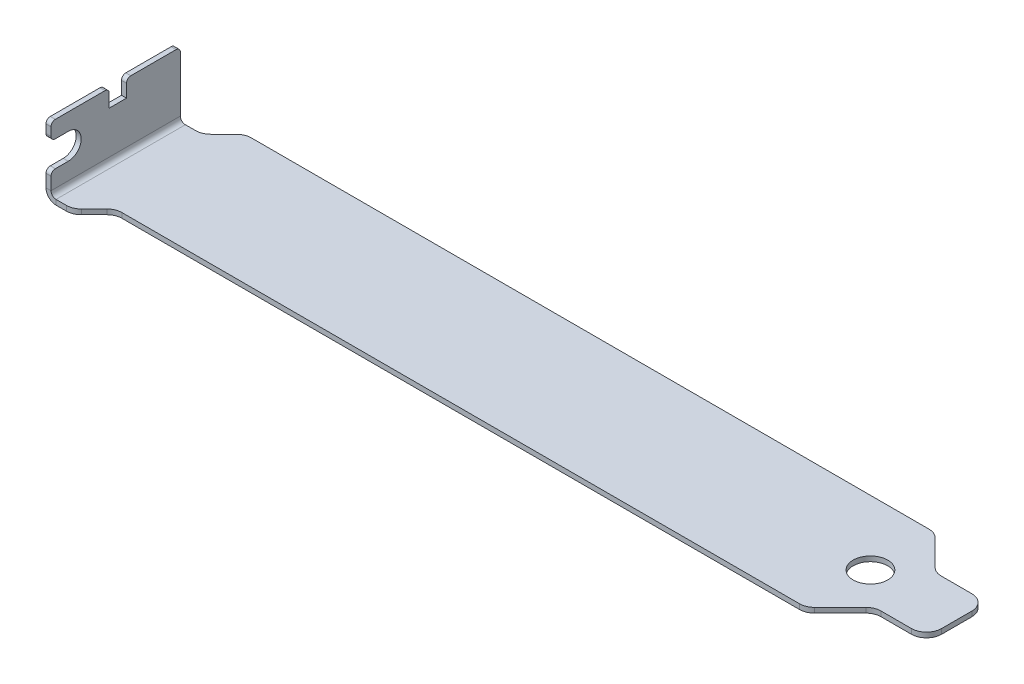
ISO-10303-21;
HEADER;
FILE_DESCRIPTION(('STEP AP214'),'2;1');
FILE_NAME('part.step','',(''),(''),'','','');
FILE_SCHEMA(('AUTOMOTIVE_DESIGN { 1 0 10303 214 1 1 1 1 }'));
ENDSEC;
DATA;
#1=APPLICATION_CONTEXT('core data for automotive mechanical design processes');
#2=APPLICATION_PROTOCOL_DEFINITION('international standard','automotive_design',2000,#1);
#3=PRODUCT_CONTEXT('',#1,'mechanical');
#4=PRODUCT('Part','Part','',(#3));
#5=PRODUCT_RELATED_PRODUCT_CATEGORY('part','',(#4));
#6=PRODUCT_DEFINITION_FORMATION('','',#4);
#7=PRODUCT_DEFINITION_CONTEXT('part definition',#1,'design');
#8=PRODUCT_DEFINITION('design','',#6,#7);
#9=PRODUCT_DEFINITION_SHAPE('','',#8);
#10=(LENGTH_UNIT() NAMED_UNIT(*) SI_UNIT(.MILLI.,.METRE.));
#11=(NAMED_UNIT(*) PLANE_ANGLE_UNIT() SI_UNIT($,.RADIAN.));
#12=(NAMED_UNIT(*) SI_UNIT($,.STERADIAN.) SOLID_ANGLE_UNIT());
#13=UNCERTAINTY_MEASURE_WITH_UNIT(LENGTH_MEASURE(1.E-05),#10,'distance_accuracy_value','');
#14=(GEOMETRIC_REPRESENTATION_CONTEXT(3) GLOBAL_UNCERTAINTY_ASSIGNED_CONTEXT((#13)) GLOBAL_UNIT_ASSIGNED_CONTEXT((#10,
#11,#12)) REPRESENTATION_CONTEXT('',''));
#15=CARTESIAN_POINT('',(0.,0.,0.));
#16=DIRECTION('',(0.,0.,1.));
#17=DIRECTION('',(1.,0.,0.));
#18=AXIS2_PLACEMENT_3D('',#15,#16,#17);
#19=CARTESIAN_POINT('',(-7.08660000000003,10.2616,-15.875));
#20=DIRECTION('',(0.,-1.,0.));
#21=DIRECTION('',(1.,0.,0.));
#22=AXIS2_PLACEMENT_3D('',#19,#20,#21);
#23=PLANE('',#22);
#24=DIRECTION('',(0.,0.,-1.));
#25=VECTOR('',#24,1.);
#26=CARTESIAN_POINT('',(-7.08660000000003,10.2616,-15.875));
#27=LINE('',#26,#25);
#28=CARTESIAN_POINT('',(-7.08660000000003,10.2616,2.53999999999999));
#29=VERTEX_POINT('',#28);
#30=CARTESIAN_POINT('',(-7.08660000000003,10.2616,-4.7625));
#31=VERTEX_POINT('',#30);
#32=EDGE_CURVE('E382',#29,#31,#27,.T.);
#33=ORIENTED_EDGE('',*,*,#32,.F.);
#34=DIRECTION('',(1.,0.,0.));
#35=VECTOR('',#34,1.);
#36=CARTESIAN_POINT('',(-7.08660000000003,10.2616,2.53999999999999));
#37=LINE('',#36,#35);
#38=CARTESIAN_POINT('',(-6.35000000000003,10.2616,2.53999999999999));
#39=VERTEX_POINT('',#38);
#40=EDGE_CURVE('E602',#29,#39,#37,.T.);
#41=ORIENTED_EDGE('',*,*,#40,.T.);
#42=DIRECTION('',(0.,0.,-1.));
#43=VECTOR('',#42,1.);
#44=CARTESIAN_POINT('',(-6.35000000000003,10.2616,-15.875));
#45=LINE('',#44,#43);
#46=CARTESIAN_POINT('',(-6.35000000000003,10.2616,-4.7625));
#47=VERTEX_POINT('',#46);
#48=EDGE_CURVE('E380',#39,#47,#45,.T.);
#49=ORIENTED_EDGE('',*,*,#48,.T.);
#50=DIRECTION('',(1.,0.,0.));
#51=VECTOR('',#50,1.);
#52=CARTESIAN_POINT('',(-7.08660000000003,10.2616,-4.7625));
#53=LINE('',#52,#51);
#54=EDGE_CURVE('E601',#47,#31,#53,.F.);
#55=ORIENTED_EDGE('',*,*,#54,.T.);
#56=EDGE_LOOP('',(#33,#41,#49,#55));
#57=FACE_BOUND('',#56,.T.);
#58=ADVANCED_FACE('F50',(#57),#23,.F.);
#59=CARTESIAN_POINT('',(-7.08660000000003,10.2616,3.17499999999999));
#60=DIRECTION('',(0.,0.,-1.));
#61=DIRECTION('',(0.,1.,0.));
#62=AXIS2_PLACEMENT_3D('',#59,#60,#61);
#63=PLANE('',#62);
#64=DIRECTION('',(0.,1.,0.));
#65=VECTOR('',#64,1.);
#66=CARTESIAN_POINT('',(-6.35000000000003,10.2616,3.17499999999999));
#67=LINE('',#66,#65);
#68=CARTESIAN_POINT('',(-6.35,1.4732,3.175));
#69=VERTEX_POINT('',#68);
#70=CARTESIAN_POINT('',(-6.35000000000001,3.3274,3.175));
#71=VERTEX_POINT('',#70);
#72=EDGE_CURVE('E387',#69,#71,#67,.T.);
#73=ORIENTED_EDGE('',*,*,#72,.T.);
#74=DIRECTION('',(1.,0.,0.));
#75=VECTOR('',#74,1.);
#76=CARTESIAN_POINT('',(-7.08660000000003,3.3274,3.175));
#77=LINE('',#76,#75);
#78=CARTESIAN_POINT('',(-7.08660000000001,3.3274,3.175));
#79=VERTEX_POINT('',#78);
#80=EDGE_CURVE('E581',#71,#79,#77,.F.);
#81=ORIENTED_EDGE('',*,*,#80,.T.);
#82=DIRECTION('',(0.,1.,0.));
#83=VECTOR('',#82,1.);
#84=CARTESIAN_POINT('',(-7.08660000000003,10.2616,3.17499999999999));
#85=LINE('',#84,#83);
#86=CARTESIAN_POINT('',(-7.0866,1.47319999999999,3.175));
#87=VERTEX_POINT('',#86);
#88=EDGE_CURVE('E378',#87,#79,#85,.T.);
#89=ORIENTED_EDGE('',*,*,#88,.F.);
#90=DIRECTION('',(-1.,0.,0.));
#91=VECTOR('',#90,1.);
#92=CARTESIAN_POINT('',(-6.35,1.4732,3.175));
#93=LINE('',#92,#91);
#94=EDGE_CURVE('E364',#69,#87,#93,.T.);
#95=ORIENTED_EDGE('',*,*,#94,.F.);
#96=EDGE_LOOP('',(#73,#81,#89,#95));
#97=FACE_BOUND('',#96,.T.);
#98=ADVANCED_FACE('F661',(#97),#63,.F.);
#99=CARTESIAN_POINT('',(-4.09558964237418,0.7366,-15.875));
#100=DIRECTION('',(0.,0.,1.));
#101=DIRECTION('',(1.,0.,0.));
#102=AXIS2_PLACEMENT_3D('',#99,#100,#101);
#103=PLANE('',#102);
#104=DIRECTION('',(0.,-1.,0.));
#105=VECTOR('',#104,1.);
#106=CARTESIAN_POINT('',(-5.6134,0.736599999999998,-15.875));
#107=LINE('',#106,#105);
#108=CARTESIAN_POINT('',(-5.6134,0.7366,-15.875));
#109=VERTEX_POINT('',#108);
#110=CARTESIAN_POINT('',(-5.6134,0.,-15.875));
#111=VERTEX_POINT('',#110);
#112=EDGE_CURVE('E406',#109,#111,#107,.T.);
#113=ORIENTED_EDGE('',*,*,#112,.F.);
#114=DIRECTION('',(-1.,0.,0.));
#115=VECTOR('',#114,1.);
#116=CARTESIAN_POINT('',(-4.09558964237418,0.7366,-15.875));
#117=LINE('',#116,#115);
#118=CARTESIAN_POINT('',(-4.09558964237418,0.7366,-15.875));
#119=VERTEX_POINT('',#118);
#120=EDGE_CURVE('E455',#119,#109,#117,.T.);
#121=ORIENTED_EDGE('',*,*,#120,.F.);
#122=DIRECTION('',(0.,-1.,0.));
#123=VECTOR('',#122,1.);
#124=CARTESIAN_POINT('',(-4.09558964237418,0.7366,-15.875));
#125=LINE('',#124,#123);
#126=CARTESIAN_POINT('',(-4.09558964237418,0.,-15.875));
#127=VERTEX_POINT('',#126);
#128=EDGE_CURVE('E525',#119,#127,#125,.T.);
#129=ORIENTED_EDGE('',*,*,#128,.T.);
#130=DIRECTION('',(-1.,0.,0.));
#131=VECTOR('',#130,1.);
#132=CARTESIAN_POINT('',(-4.09558964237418,0.,-15.875));
#133=LINE('',#132,#131);
#134=EDGE_CURVE('E500',#127,#111,#133,.T.);
#135=ORIENTED_EDGE('',*,*,#134,.T.);
#136=EDGE_LOOP('',(#113,#121,#129,#135));
#137=FACE_BOUND('',#136,.T.);
#138=ADVANCED_FACE('F648',(#137),#103,.F.);
#139=CARTESIAN_POINT('',(-6.35,0.7366,3.175));
#140=DIRECTION('',(0.,0.,-1.));
#141=DIRECTION('',(-1.,0.,0.));
#142=AXIS2_PLACEMENT_3D('',#139,#140,#141);
#143=PLANE('',#142);
#144=DIRECTION('',(0.,-1.,0.));
#145=VECTOR('',#144,1.);
#146=CARTESIAN_POINT('',(-5.6134,0.736599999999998,3.175));
#147=LINE('',#146,#145);
#148=CARTESIAN_POINT('',(-5.6134,0.7366,3.175));
#149=VERTEX_POINT('',#148);
#150=CARTESIAN_POINT('',(-5.6134,0.,3.175));
#151=VERTEX_POINT('',#150);
#152=EDGE_CURVE('E400',#149,#151,#147,.T.);
#153=ORIENTED_EDGE('',*,*,#152,.T.);
#154=DIRECTION('',(1.,0.,0.));
#155=VECTOR('',#154,1.);
#156=CARTESIAN_POINT('',(-6.35,0.,3.175));
#157=LINE('',#156,#155);
#158=CARTESIAN_POINT('',(-4.0955896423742,0.,3.175));
#159=VERTEX_POINT('',#158);
#160=EDGE_CURVE('E498',#151,#159,#157,.T.);
#161=ORIENTED_EDGE('',*,*,#160,.T.);
#162=DIRECTION('',(0.,-1.,0.));
#163=VECTOR('',#162,1.);
#164=CARTESIAN_POINT('',(-4.0955896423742,0.7366,3.175));
#165=LINE('',#164,#163);
#166=CARTESIAN_POINT('',(-4.0955896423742,0.7366,3.175));
#167=VERTEX_POINT('',#166);
#168=EDGE_CURVE('E516',#167,#159,#165,.T.);
#169=ORIENTED_EDGE('',*,*,#168,.F.);
#170=DIRECTION('',(1.,0.,0.));
#171=VECTOR('',#170,1.);
#172=CARTESIAN_POINT('',(-6.35,0.7366,3.175));
#173=LINE('',#172,#171);
#174=EDGE_CURVE('E457',#149,#167,#173,.T.);
#175=ORIENTED_EDGE('',*,*,#174,.F.);
#176=EDGE_LOOP('',(#153,#161,#169,#175));
#177=FACE_BOUND('',#176,.T.);
#178=ADVANCED_FACE('F872',(#177),#143,.F.);
#179=CARTESIAN_POINT('',(100.679410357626,0.7366,-2.2225));
#180=DIRECTION('',(0.,1.,0.));
#181=DIRECTION('',(0.,0.,1.));
#182=AXIS2_PLACEMENT_3D('',#179,#180,#181);
#183=PLANE('',#182);
#184=CARTESIAN_POINT('',(101.6,0.7366,-9.525));
#185=DIRECTION('',(0.,1.,0.));
#186=DIRECTION('',(0.,0.,1.));
#187=AXIS2_PLACEMENT_3D('',#184,#185,#186);
#188=CIRCLE('',#187,2.54);
#189=CARTESIAN_POINT('',(101.6,0.7366,-6.985));
#190=VERTEX_POINT('',#189);
#191=EDGE_CURVE('E415',#190,#190,#188,.T.);
#192=ORIENTED_EDGE('',*,*,#191,.F.);
#193=EDGE_LOOP('',(#192));
#194=FACE_BOUND('',#193,.T.);
#195=ORIENTED_EDGE('',*,*,#120,.T.);
#196=DIRECTION('',(0.,0.,1.));
#197=VECTOR('',#196,1.);
#198=CARTESIAN_POINT('',(-5.6134,0.736599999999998,3.175));
#199=LINE('',#198,#197);
#200=EDGE_CURVE('E404',#149,#109,#199,.F.);
#201=ORIENTED_EDGE('',*,*,#200,.F.);
#202=ORIENTED_EDGE('',*,*,#174,.T.);
#203=CARTESIAN_POINT('',(-4.0955896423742,0.7366,0.952500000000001));
#204=DIRECTION('',(0.,1.,0.));
#205=DIRECTION('',(0.,0.,1.));
#206=AXIS2_PLACEMENT_3D('',#203,#204,#205);
#207=CIRCLE('',#206,2.2225);
#208=CARTESIAN_POINT('',(-2.52404482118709,0.7366,2.52404482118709));
#209=VERTEX_POINT('',#208);
#210=EDGE_CURVE('E456',#167,#209,#207,.T.);
#211=ORIENTED_EDGE('',*,*,#210,.T.);
#212=DIRECTION('',(0.707106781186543,0.,-0.707106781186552));
#213=VECTOR('',#212,1.);
#214=CARTESIAN_POINT('',(-2.52404482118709,0.7366,2.52404482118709));
#215=LINE('',#214,#213);
#216=CARTESIAN_POINT('',(-0.650955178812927,0.7366,0.650955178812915));
#217=VERTEX_POINT('',#216);
#218=EDGE_CURVE('E458',#209,#217,#215,.T.);
#219=ORIENTED_EDGE('',*,*,#218,.T.);
#220=CARTESIAN_POINT('',(0.920589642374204,0.7366,2.2225));
#221=DIRECTION('',(0.,-1.,0.));
#222=DIRECTION('',(0.,0.,1.));
#223=AXIS2_PLACEMENT_3D('',#220,#221,#222);
#224=CIRCLE('',#223,2.22250000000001);
#225=CARTESIAN_POINT('',(0.920589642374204,0.7366,0.));
#226=VERTEX_POINT('',#225);
#227=EDGE_CURVE('E464',#217,#226,#224,.T.);
#228=ORIENTED_EDGE('',*,*,#227,.T.);
#229=DIRECTION('',(1.,0.,0.));
#230=VECTOR('',#229,1.);
#231=CARTESIAN_POINT('',(0.920589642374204,0.7366,0.));
#232=LINE('',#231,#230);
#233=CARTESIAN_POINT('',(100.679410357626,0.7366,0.));
#234=VERTEX_POINT('',#233);
#235=EDGE_CURVE('E465',#226,#234,#232,.T.);
#236=ORIENTED_EDGE('',*,*,#235,.T.);
#237=CARTESIAN_POINT('',(100.679410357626,0.7366,-2.2225));
#238=DIRECTION('',(0.,1.,0.));
#239=DIRECTION('',(0.,0.,1.));
#240=AXIS2_PLACEMENT_3D('',#237,#238,#239);
#241=CIRCLE('',#240,2.2225);
#242=CARTESIAN_POINT('',(102.250955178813,0.7366,-0.650955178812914));
#243=VERTEX_POINT('',#242);
#244=EDGE_CURVE('E423',#234,#243,#241,.T.);
#245=ORIENTED_EDGE('',*,*,#244,.T.);
#246=DIRECTION('',(0.70710678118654,0.,-0.707106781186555));
#247=VECTOR('',#246,1.);
#248=CARTESIAN_POINT('',(102.250955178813,0.7366,-0.650955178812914));
#249=LINE('',#248,#247);
#250=CARTESIAN_POINT('',(106.029044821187,0.7366,-4.42904482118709));
#251=VERTEX_POINT('',#250);
#252=EDGE_CURVE('E424',#243,#251,#249,.T.);
#253=ORIENTED_EDGE('',*,*,#252,.T.);
#254=CARTESIAN_POINT('',(107.600589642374,0.7366,-2.8575));
#255=DIRECTION('',(0.,-1.,0.));
#256=DIRECTION('',(0.,0.,-1.));
#257=AXIS2_PLACEMENT_3D('',#254,#255,#256);
#258=CIRCLE('',#257,2.2225);
#259=CARTESIAN_POINT('',(107.600589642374,0.7366,-5.08));
#260=VERTEX_POINT('',#259);
#261=EDGE_CURVE('E430',#251,#260,#258,.T.);
#262=ORIENTED_EDGE('',*,*,#261,.T.);
#263=DIRECTION('',(1.,0.,0.));
#264=VECTOR('',#263,1.);
#265=CARTESIAN_POINT('',(107.600589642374,0.7366,-5.08));
#266=LINE('',#265,#264);
#267=CARTESIAN_POINT('',(112.0775,0.7366,-5.08));
#268=VERTEX_POINT('',#267);
#269=EDGE_CURVE('E427',#260,#268,#266,.T.);
#270=ORIENTED_EDGE('',*,*,#269,.T.);
#271=CARTESIAN_POINT('',(112.0775,0.7366,-7.3025));
#272=DIRECTION('',(0.,1.,0.));
#273=DIRECTION('',(0.,0.,1.));
#274=AXIS2_PLACEMENT_3D('',#271,#272,#273);
#275=CIRCLE('',#274,2.2225);
#276=CARTESIAN_POINT('',(114.3,0.7366,-7.3025));
#277=VERTEX_POINT('',#276);
#278=EDGE_CURVE('E431',#268,#277,#275,.T.);
#279=ORIENTED_EDGE('',*,*,#278,.T.);
#280=DIRECTION('',(0.,0.,-1.));
#281=VECTOR('',#280,1.);
#282=CARTESIAN_POINT('',(114.3,0.7366,-11.7475));
#283=LINE('',#282,#281);
#284=CARTESIAN_POINT('',(114.3,0.7366,-11.7475));
#285=VERTEX_POINT('',#284);
#286=EDGE_CURVE('E433',#277,#285,#283,.T.);
#287=ORIENTED_EDGE('',*,*,#286,.T.);
#288=CARTESIAN_POINT('',(112.0775,0.7366,-11.7475));
#289=DIRECTION('',(0.,1.,0.));
#290=DIRECTION('',(0.,0.,-1.));
#291=AXIS2_PLACEMENT_3D('',#288,#289,#290);
#292=CIRCLE('',#291,2.2225);
#293=CARTESIAN_POINT('',(112.0775,0.7366,-13.97));
#294=VERTEX_POINT('',#293);
#295=EDGE_CURVE('E434',#285,#294,#292,.T.);
#296=ORIENTED_EDGE('',*,*,#295,.T.);
#297=DIRECTION('',(-1.,0.,0.));
#298=VECTOR('',#297,1.);
#299=CARTESIAN_POINT('',(107.600589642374,0.7366,-13.97));
#300=LINE('',#299,#298);
#301=CARTESIAN_POINT('',(107.600589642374,0.7366,-13.97));
#302=VERTEX_POINT('',#301);
#303=EDGE_CURVE('E440',#294,#302,#300,.T.);
#304=ORIENTED_EDGE('',*,*,#303,.T.);
#305=CARTESIAN_POINT('',(107.600589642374,0.7366,-16.1925));
#306=DIRECTION('',(0.,-1.,0.));
#307=DIRECTION('',(0.,0.,1.));
#308=AXIS2_PLACEMENT_3D('',#305,#306,#307);
#309=CIRCLE('',#308,2.2225);
#310=CARTESIAN_POINT('',(106.029044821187,0.7366,-14.6209551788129));
#311=VERTEX_POINT('',#310);
#312=EDGE_CURVE('E438',#302,#311,#309,.T.);
#313=ORIENTED_EDGE('',*,*,#312,.T.);
#314=DIRECTION('',(-0.707106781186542,0.,-0.707106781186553));
#315=VECTOR('',#314,1.);
#316=CARTESIAN_POINT('',(102.250955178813,0.7366,-18.3990448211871));
#317=LINE('',#316,#315);
#318=CARTESIAN_POINT('',(102.250955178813,0.7366,-18.3990448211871));
#319=VERTEX_POINT('',#318);
#320=EDGE_CURVE('E442',#311,#319,#317,.T.);
#321=ORIENTED_EDGE('',*,*,#320,.T.);
#322=CARTESIAN_POINT('',(100.679410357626,0.7366,-16.8275));
#323=DIRECTION('',(0.,1.,0.));
#324=DIRECTION('',(0.,0.,-1.));
#325=AXIS2_PLACEMENT_3D('',#322,#323,#324);
#326=CIRCLE('',#325,2.2225);
#327=CARTESIAN_POINT('',(100.679410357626,0.7366,-19.05));
#328=VERTEX_POINT('',#327);
#329=EDGE_CURVE('E444',#319,#328,#326,.T.);
#330=ORIENTED_EDGE('',*,*,#329,.T.);
#331=DIRECTION('',(-1.,0.,0.));
#332=VECTOR('',#331,1.);
#333=CARTESIAN_POINT('',(0.920589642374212,0.7366,-19.05));
#334=LINE('',#333,#332);
#335=CARTESIAN_POINT('',(0.920589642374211,0.7366,-19.05));
#336=VERTEX_POINT('',#335);
#337=EDGE_CURVE('E443',#328,#336,#334,.T.);
#338=ORIENTED_EDGE('',*,*,#337,.T.);
#339=CARTESIAN_POINT('',(0.920589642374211,0.7366,-16.8275));
#340=DIRECTION('',(0.,1.,0.));
#341=DIRECTION('',(0.,0.,-1.));
#342=AXIS2_PLACEMENT_3D('',#339,#340,#341);
#343=CIRCLE('',#342,2.2225);
#344=CARTESIAN_POINT('',(-0.650955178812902,0.7366,-18.3990448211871));
#345=VERTEX_POINT('',#344);
#346=EDGE_CURVE('E447',#336,#345,#343,.T.);
#347=ORIENTED_EDGE('',*,*,#346,.T.);
#348=DIRECTION('',(-0.707106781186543,0.,0.707106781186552));
#349=VECTOR('',#348,1.);
#350=CARTESIAN_POINT('',(-0.650955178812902,0.7366,-18.3990448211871));
#351=LINE('',#350,#349);
#352=CARTESIAN_POINT('',(-2.52404482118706,0.7366,-16.5259551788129));
#353=VERTEX_POINT('',#352);
#354=EDGE_CURVE('E448',#345,#353,#351,.T.);
#355=ORIENTED_EDGE('',*,*,#354,.T.);
#356=CARTESIAN_POINT('',(-4.09558964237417,0.7366,-18.0975));
#357=DIRECTION('',(0.,-1.,0.));
#358=DIRECTION('',(0.,0.,-1.));
#359=AXIS2_PLACEMENT_3D('',#356,#357,#358);
#360=CIRCLE('',#359,2.2225);
#361=EDGE_CURVE('E452',#353,#119,#360,.T.);
#362=ORIENTED_EDGE('',*,*,#361,.T.);
#363=EDGE_LOOP('',(#195,#201,#202,#211,#219,#228,#236,#245,#253,#262,#270,#279,#287,#296,#304,
#313,#321,#330,#338,#347,#355,#362));
#364=FACE_BOUND('',#363,.T.);
#365=ADVANCED_FACE('F651',(#194,#364),#183,.T.);
#366=CARTESIAN_POINT('',(100.679410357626,0.,-2.2225));
#367=DIRECTION('',(0.,1.,0.));
#368=DIRECTION('',(0.,0.,1.));
#369=AXIS2_PLACEMENT_3D('',#366,#367,#368);
#370=PLANE('',#369);
#371=CARTESIAN_POINT('',(101.6,0.,-9.525));
#372=DIRECTION('',(0.,1.,0.));
#373=DIRECTION('',(0.,0.,1.));
#374=AXIS2_PLACEMENT_3D('',#371,#372,#373);
#375=CIRCLE('',#374,2.54);
#376=CARTESIAN_POINT('',(101.6,0.,-6.985));
#377=VERTEX_POINT('',#376);
#378=EDGE_CURVE('E413',#377,#377,#375,.T.);
#379=ORIENTED_EDGE('',*,*,#378,.T.);
#380=EDGE_LOOP('',(#379));
#381=FACE_BOUND('',#380,.T.);
#382=DIRECTION('',(0.,0.,1.));
#383=VECTOR('',#382,1.);
#384=CARTESIAN_POINT('',(-5.6134,0.,3.175));
#385=LINE('',#384,#383);
#386=EDGE_CURVE('E392',#151,#111,#385,.F.);
#387=ORIENTED_EDGE('',*,*,#386,.T.);
#388=ORIENTED_EDGE('',*,*,#134,.F.);
#389=CARTESIAN_POINT('',(-4.09558964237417,0.,-18.0975));
#390=DIRECTION('',(0.,-1.,0.));
#391=DIRECTION('',(0.,0.,-1.));
#392=AXIS2_PLACEMENT_3D('',#389,#390,#391);
#393=CIRCLE('',#392,2.2225);
#394=CARTESIAN_POINT('',(-2.52404482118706,0.,-16.5259551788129));
#395=VERTEX_POINT('',#394);
#396=EDGE_CURVE('E494',#395,#127,#393,.T.);
#397=ORIENTED_EDGE('',*,*,#396,.F.);
#398=DIRECTION('',(-0.707106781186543,0.,0.707106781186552));
#399=VECTOR('',#398,1.);
#400=CARTESIAN_POINT('',(-0.650955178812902,0.,-18.3990448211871));
#401=LINE('',#400,#399);
#402=CARTESIAN_POINT('',(-0.650955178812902,0.,-18.3990448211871));
#403=VERTEX_POINT('',#402);
#404=EDGE_CURVE('E492',#403,#395,#401,.T.);
#405=ORIENTED_EDGE('',*,*,#404,.F.);
#406=CARTESIAN_POINT('',(0.920589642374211,0.,-16.8275));
#407=DIRECTION('',(0.,1.,0.));
#408=DIRECTION('',(0.,0.,-1.));
#409=AXIS2_PLACEMENT_3D('',#406,#407,#408);
#410=CIRCLE('',#409,2.2225);
#411=CARTESIAN_POINT('',(0.920589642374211,0.,-19.05));
#412=VERTEX_POINT('',#411);
#413=EDGE_CURVE('E491',#412,#403,#410,.T.);
#414=ORIENTED_EDGE('',*,*,#413,.F.);
#415=DIRECTION('',(-1.,0.,0.));
#416=VECTOR('',#415,1.);
#417=CARTESIAN_POINT('',(0.920589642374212,0.,-19.05));
#418=LINE('',#417,#416);
#419=CARTESIAN_POINT('',(100.679410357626,0.,-19.05));
#420=VERTEX_POINT('',#419);
#421=EDGE_CURVE('E487',#420,#412,#418,.T.);
#422=ORIENTED_EDGE('',*,*,#421,.F.);
#423=CARTESIAN_POINT('',(100.679410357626,0.,-16.8275));
#424=DIRECTION('',(0.,1.,0.));
#425=DIRECTION('',(0.,0.,-1.));
#426=AXIS2_PLACEMENT_3D('',#423,#424,#425);
#427=CIRCLE('',#426,2.2225);
#428=CARTESIAN_POINT('',(102.250955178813,0.,-18.3990448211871));
#429=VERTEX_POINT('',#428);
#430=EDGE_CURVE('E490',#429,#420,#427,.T.);
#431=ORIENTED_EDGE('',*,*,#430,.F.);
#432=DIRECTION('',(-0.707106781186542,0.,-0.707106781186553));
#433=VECTOR('',#432,1.);
#434=CARTESIAN_POINT('',(102.250955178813,0.,-18.3990448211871));
#435=LINE('',#434,#433);
#436=CARTESIAN_POINT('',(106.029044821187,0.,-14.6209551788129));
#437=VERTEX_POINT('',#436);
#438=EDGE_CURVE('E484',#437,#429,#435,.T.);
#439=ORIENTED_EDGE('',*,*,#438,.F.);
#440=CARTESIAN_POINT('',(107.600589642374,0.,-16.1925));
#441=DIRECTION('',(0.,-1.,0.));
#442=DIRECTION('',(0.,0.,1.));
#443=AXIS2_PLACEMENT_3D('',#440,#441,#442);
#444=CIRCLE('',#443,2.2225);
#445=CARTESIAN_POINT('',(107.600589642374,0.,-13.97));
#446=VERTEX_POINT('',#445);
#447=EDGE_CURVE('E483',#446,#437,#444,.T.);
#448=ORIENTED_EDGE('',*,*,#447,.F.);
#449=DIRECTION('',(-1.,0.,0.));
#450=VECTOR('',#449,1.);
#451=CARTESIAN_POINT('',(107.600589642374,0.,-13.97));
#452=LINE('',#451,#450);
#453=CARTESIAN_POINT('',(112.0775,0.,-13.97));
#454=VERTEX_POINT('',#453);
#455=EDGE_CURVE('E481',#454,#446,#452,.T.);
#456=ORIENTED_EDGE('',*,*,#455,.F.);
#457=CARTESIAN_POINT('',(112.0775,0.,-11.7475));
#458=DIRECTION('',(0.,1.,0.));
#459=DIRECTION('',(0.,0.,-1.));
#460=AXIS2_PLACEMENT_3D('',#457,#458,#459);
#461=CIRCLE('',#460,2.2225);
#462=CARTESIAN_POINT('',(114.3,0.,-11.7475));
#463=VERTEX_POINT('',#462);
#464=EDGE_CURVE('E479',#463,#454,#461,.T.);
#465=ORIENTED_EDGE('',*,*,#464,.F.);
#466=DIRECTION('',(0.,0.,-1.));
#467=VECTOR('',#466,1.);
#468=CARTESIAN_POINT('',(114.3,0.,-11.7475));
#469=LINE('',#468,#467);
#470=CARTESIAN_POINT('',(114.3,0.,-7.3025));
#471=VERTEX_POINT('',#470);
#472=EDGE_CURVE('E480',#471,#463,#469,.T.);
#473=ORIENTED_EDGE('',*,*,#472,.F.);
#474=CARTESIAN_POINT('',(112.0775,0.,-7.3025));
#475=DIRECTION('',(0.,1.,0.));
#476=DIRECTION('',(0.,0.,1.));
#477=AXIS2_PLACEMENT_3D('',#474,#475,#476);
#478=CIRCLE('',#477,2.2225);
#479=CARTESIAN_POINT('',(112.0775,0.,-5.08));
#480=VERTEX_POINT('',#479);
#481=EDGE_CURVE('E474',#480,#471,#478,.T.);
#482=ORIENTED_EDGE('',*,*,#481,.F.);
#483=DIRECTION('',(1.,0.,0.));
#484=VECTOR('',#483,1.);
#485=CARTESIAN_POINT('',(107.600589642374,0.,-5.08));
#486=LINE('',#485,#484);
#487=CARTESIAN_POINT('',(107.600589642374,0.,-5.08));
#488=VERTEX_POINT('',#487);
#489=EDGE_CURVE('E471',#488,#480,#486,.T.);
#490=ORIENTED_EDGE('',*,*,#489,.F.);
#491=CARTESIAN_POINT('',(107.600589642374,0.,-2.8575));
#492=DIRECTION('',(0.,-1.,0.));
#493=DIRECTION('',(0.,0.,-1.));
#494=AXIS2_PLACEMENT_3D('',#491,#492,#493);
#495=CIRCLE('',#494,2.2225);
#496=CARTESIAN_POINT('',(106.029044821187,0.,-4.42904482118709));
#497=VERTEX_POINT('',#496);
#498=EDGE_CURVE('E473',#497,#488,#495,.T.);
#499=ORIENTED_EDGE('',*,*,#498,.F.);
#500=DIRECTION('',(0.70710678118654,0.,-0.707106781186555));
#501=VECTOR('',#500,1.);
#502=CARTESIAN_POINT('',(102.250955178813,0.,-0.650955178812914));
#503=LINE('',#502,#501);
#504=CARTESIAN_POINT('',(102.250955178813,0.,-0.650955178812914));
#505=VERTEX_POINT('',#504);
#506=EDGE_CURVE('E466',#505,#497,#503,.T.);
#507=ORIENTED_EDGE('',*,*,#506,.F.);
#508=CARTESIAN_POINT('',(100.679410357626,0.,-2.2225));
#509=DIRECTION('',(0.,1.,0.));
#510=DIRECTION('',(0.,0.,1.));
#511=AXIS2_PLACEMENT_3D('',#508,#509,#510);
#512=CIRCLE('',#511,2.2225);
#513=CARTESIAN_POINT('',(100.679410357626,0.,0.));
#514=VERTEX_POINT('',#513);
#515=EDGE_CURVE('E416',#514,#505,#512,.T.);
#516=ORIENTED_EDGE('',*,*,#515,.F.);
#517=DIRECTION('',(1.,0.,0.));
#518=VECTOR('',#517,1.);
#519=CARTESIAN_POINT('',(0.920589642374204,0.,0.));
#520=LINE('',#519,#518);
#521=CARTESIAN_POINT('',(0.920589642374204,0.,0.));
#522=VERTEX_POINT('',#521);
#523=EDGE_CURVE('E422',#522,#514,#520,.T.);
#524=ORIENTED_EDGE('',*,*,#523,.F.);
#525=CARTESIAN_POINT('',(0.920589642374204,0.,2.2225));
#526=DIRECTION('',(0.,-1.,0.));
#527=DIRECTION('',(0.,0.,1.));
#528=AXIS2_PLACEMENT_3D('',#525,#526,#527);
#529=CIRCLE('',#528,2.22250000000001);
#530=CARTESIAN_POINT('',(-0.650955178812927,0.,0.650955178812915));
#531=VERTEX_POINT('',#530);
#532=EDGE_CURVE('E507',#531,#522,#529,.T.);
#533=ORIENTED_EDGE('',*,*,#532,.F.);
#534=DIRECTION('',(0.707106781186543,0.,-0.707106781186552));
#535=VECTOR('',#534,1.);
#536=CARTESIAN_POINT('',(-2.52404482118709,0.,2.52404482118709));
#537=LINE('',#536,#535);
#538=CARTESIAN_POINT('',(-2.52404482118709,0.,2.52404482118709));
#539=VERTEX_POINT('',#538);
#540=EDGE_CURVE('E503',#539,#531,#537,.T.);
#541=ORIENTED_EDGE('',*,*,#540,.F.);
#542=CARTESIAN_POINT('',(-4.0955896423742,0.,0.952500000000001));
#543=DIRECTION('',(0.,1.,0.));
#544=DIRECTION('',(0.,0.,1.));
#545=AXIS2_PLACEMENT_3D('',#542,#543,#544);
#546=CIRCLE('',#545,2.2225);
#547=EDGE_CURVE('E502',#159,#539,#546,.T.);
#548=ORIENTED_EDGE('',*,*,#547,.F.);
#549=ORIENTED_EDGE('',*,*,#160,.F.);
#550=EDGE_LOOP('',(#387,#388,#397,#405,#414,#422,#431,#439,#448,#456,#465,#473,#482,#490,#499,
#507,#516,#524,#533,#541,#548,#549));
#551=FACE_BOUND('',#550,.T.);
#552=ADVANCED_FACE('F895',(#381,#551),#370,.F.);
#553=CARTESIAN_POINT('',(100.679410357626,0.7366,-2.2225));
#554=DIRECTION('',(0.,-1.,0.));
#555=DIRECTION('',(0.,0.,-1.));
#556=AXIS2_PLACEMENT_3D('',#553,#554,#555);
#557=CYLINDRICAL_SURFACE('',#556,2.2225);
#558=ORIENTED_EDGE('',*,*,#515,.T.);
#559=DIRECTION('',(0.,-1.,0.));
#560=VECTOR('',#559,1.);
#561=CARTESIAN_POINT('',(102.250955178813,0.7366,-0.650955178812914));
#562=LINE('',#561,#560);
#563=EDGE_CURVE('E563',#243,#505,#562,.T.);
#564=ORIENTED_EDGE('',*,*,#563,.F.);
#565=ORIENTED_EDGE('',*,*,#244,.F.);
#566=DIRECTION('',(0.,-1.,0.));
#567=VECTOR('',#566,1.);
#568=CARTESIAN_POINT('',(100.679410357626,0.7366,0.));
#569=LINE('',#568,#567);
#570=EDGE_CURVE('E467',#234,#514,#569,.T.);
#571=ORIENTED_EDGE('',*,*,#570,.T.);
#572=EDGE_LOOP('',(#558,#564,#565,#571));
#573=FACE_BOUND('',#572,.T.);
#574=ADVANCED_FACE('F902',(#573),#557,.T.);
#575=CARTESIAN_POINT('',(102.250955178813,0.7366,-0.650955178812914));
#576=DIRECTION('',(-0.707106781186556,0.,-0.70710678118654));
#577=DIRECTION('',(-0.70710678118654,0.,0.707106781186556));
#578=AXIS2_PLACEMENT_3D('',#575,#576,#577);
#579=PLANE('',#578);
#580=ORIENTED_EDGE('',*,*,#506,.T.);
#581=DIRECTION('',(0.,-1.,0.));
#582=VECTOR('',#581,1.);
#583=CARTESIAN_POINT('',(106.029044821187,0.7366,-4.42904482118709));
#584=LINE('',#583,#582);
#585=EDGE_CURVE('E564',#251,#497,#584,.T.);
#586=ORIENTED_EDGE('',*,*,#585,.F.);
#587=ORIENTED_EDGE('',*,*,#252,.F.);
#588=ORIENTED_EDGE('',*,*,#563,.T.);
#589=EDGE_LOOP('',(#580,#586,#587,#588));
#590=FACE_BOUND('',#589,.T.);
#591=ADVANCED_FACE('F1063',(#590),#579,.F.);
#592=CARTESIAN_POINT('',(107.600589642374,0.7366,-2.8575));
#593=DIRECTION('',(0.,-1.,0.));
#594=DIRECTION('',(0.,0.,-1.));
#595=AXIS2_PLACEMENT_3D('',#592,#593,#594);
#596=CYLINDRICAL_SURFACE('',#595,2.2225);
#597=ORIENTED_EDGE('',*,*,#498,.T.);
#598=DIRECTION('',(0.,-1.,0.));
#599=VECTOR('',#598,1.);
#600=CARTESIAN_POINT('',(107.600589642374,0.7366,-5.08));
#601=LINE('',#600,#599);
#602=EDGE_CURVE('E558',#260,#488,#601,.T.);
#603=ORIENTED_EDGE('',*,*,#602,.F.);
#604=ORIENTED_EDGE('',*,*,#261,.F.);
#605=ORIENTED_EDGE('',*,*,#585,.T.);
#606=EDGE_LOOP('',(#597,#603,#604,#605));
#607=FACE_BOUND('',#606,.T.);
#608=ADVANCED_FACE('F1057',(#607),#596,.F.);
#609=CARTESIAN_POINT('',(107.600589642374,0.7366,-5.08));
#610=DIRECTION('',(0.,0.,-1.));
#611=DIRECTION('',(-1.,0.,0.));
#612=AXIS2_PLACEMENT_3D('',#609,#610,#611);
#613=PLANE('',#612);
#614=ORIENTED_EDGE('',*,*,#489,.T.);
#615=DIRECTION('',(0.,-1.,0.));
#616=VECTOR('',#615,1.);
#617=CARTESIAN_POINT('',(112.0775,0.7366,-5.08));
#618=LINE('',#617,#616);
#619=EDGE_CURVE('E556',#268,#480,#618,.T.);
#620=ORIENTED_EDGE('',*,*,#619,.F.);
#621=ORIENTED_EDGE('',*,*,#269,.F.);
#622=ORIENTED_EDGE('',*,*,#602,.T.);
#623=EDGE_LOOP('',(#614,#620,#621,#622));
#624=FACE_BOUND('',#623,.T.);
#625=ADVANCED_FACE('F1050',(#624),#613,.F.);
#626=CARTESIAN_POINT('',(112.0775,0.7366,-7.3025));
#627=DIRECTION('',(0.,-1.,0.));
#628=DIRECTION('',(0.,0.,-1.));
#629=AXIS2_PLACEMENT_3D('',#626,#627,#628);
#630=CYLINDRICAL_SURFACE('',#629,2.2225);
#631=ORIENTED_EDGE('',*,*,#481,.T.);
#632=DIRECTION('',(0.,-1.,0.));
#633=VECTOR('',#632,1.);
#634=CARTESIAN_POINT('',(114.3,0.7366,-7.3025));
#635=LINE('',#634,#633);
#636=EDGE_CURVE('E554',#277,#471,#635,.T.);
#637=ORIENTED_EDGE('',*,*,#636,.F.);
#638=ORIENTED_EDGE('',*,*,#278,.F.);
#639=ORIENTED_EDGE('',*,*,#619,.T.);
#640=EDGE_LOOP('',(#631,#637,#638,#639));
#641=FACE_BOUND('',#640,.T.);
#642=ADVANCED_FACE('F1038',(#641),#630,.T.);
#643=CARTESIAN_POINT('',(114.3,0.7366,-11.7475));
#644=DIRECTION('',(-1.,0.,0.));
#645=DIRECTION('',(0.,0.,1.));
#646=AXIS2_PLACEMENT_3D('',#643,#644,#645);
#647=PLANE('',#646);
#648=ORIENTED_EDGE('',*,*,#472,.T.);
#649=DIRECTION('',(0.,-1.,0.));
#650=VECTOR('',#649,1.);
#651=CARTESIAN_POINT('',(114.3,0.7366,-11.7475));
#652=LINE('',#651,#650);
#653=EDGE_CURVE('E549',#285,#463,#652,.T.);
#654=ORIENTED_EDGE('',*,*,#653,.F.);
#655=ORIENTED_EDGE('',*,*,#286,.F.);
#656=ORIENTED_EDGE('',*,*,#636,.T.);
#657=EDGE_LOOP('',(#648,#654,#655,#656));
#658=FACE_BOUND('',#657,.T.);
#659=ADVANCED_FACE('F1029',(#658),#647,.F.);
#660=CARTESIAN_POINT('',(112.0775,0.7366,-11.7475));
#661=DIRECTION('',(0.,-1.,0.));
#662=DIRECTION('',(0.,0.,-1.));
#663=AXIS2_PLACEMENT_3D('',#660,#661,#662);
#664=CYLINDRICAL_SURFACE('',#663,2.2225);
#665=ORIENTED_EDGE('',*,*,#464,.T.);
#666=DIRECTION('',(0.,-1.,0.));
#667=VECTOR('',#666,1.);
#668=CARTESIAN_POINT('',(112.0775,0.7366,-13.97));
#669=LINE('',#668,#667);
#670=EDGE_CURVE('E550',#294,#454,#669,.T.);
#671=ORIENTED_EDGE('',*,*,#670,.F.);
#672=ORIENTED_EDGE('',*,*,#295,.F.);
#673=ORIENTED_EDGE('',*,*,#653,.T.);
#674=EDGE_LOOP('',(#665,#671,#672,#673));
#675=FACE_BOUND('',#674,.T.);
#676=ADVANCED_FACE('F1018',(#675),#664,.T.);
#677=CARTESIAN_POINT('',(107.600589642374,0.7366,-13.97));
#678=DIRECTION('',(0.,0.,1.));
#679=DIRECTION('',(1.,0.,0.));
#680=AXIS2_PLACEMENT_3D('',#677,#678,#679);
#681=PLANE('',#680);
#682=ORIENTED_EDGE('',*,*,#455,.T.);
#683=DIRECTION('',(0.,-1.,0.));
#684=VECTOR('',#683,1.);
#685=CARTESIAN_POINT('',(107.600589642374,0.7366,-13.97));
#686=LINE('',#685,#684);
#687=EDGE_CURVE('E542',#302,#446,#686,.T.);
#688=ORIENTED_EDGE('',*,*,#687,.F.);
#689=ORIENTED_EDGE('',*,*,#303,.F.);
#690=ORIENTED_EDGE('',*,*,#670,.T.);
#691=EDGE_LOOP('',(#682,#688,#689,#690));
#692=FACE_BOUND('',#691,.T.);
#693=ADVANCED_FACE('F1013',(#692),#681,.F.);
#694=CARTESIAN_POINT('',(107.600589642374,0.7366,-16.1925));
#695=DIRECTION('',(0.,-1.,0.));
#696=DIRECTION('',(0.,0.,-1.));
#697=AXIS2_PLACEMENT_3D('',#694,#695,#696);
#698=CYLINDRICAL_SURFACE('',#697,2.2225);
#699=ORIENTED_EDGE('',*,*,#447,.T.);
#700=DIRECTION('',(0.,-1.,0.));
#701=VECTOR('',#700,1.);
#702=CARTESIAN_POINT('',(106.029044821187,0.7366,-14.6209551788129));
#703=LINE('',#702,#701);
#704=EDGE_CURVE('E541',#311,#437,#703,.T.);
#705=ORIENTED_EDGE('',*,*,#704,.F.);
#706=ORIENTED_EDGE('',*,*,#312,.F.);
#707=ORIENTED_EDGE('',*,*,#687,.T.);
#708=EDGE_LOOP('',(#699,#705,#706,#707));
#709=FACE_BOUND('',#708,.T.);
#710=ADVANCED_FACE('F1004',(#709),#698,.F.);
#711=CARTESIAN_POINT('',(102.250955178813,0.7366,-18.3990448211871));
#712=DIRECTION('',(-0.707106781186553,0.,0.707106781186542));
#713=DIRECTION('',(0.707106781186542,0.,0.707106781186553));
#714=AXIS2_PLACEMENT_3D('',#711,#712,#713);
#715=PLANE('',#714);
#716=ORIENTED_EDGE('',*,*,#438,.T.);
#717=DIRECTION('',(0.,-1.,0.));
#718=VECTOR('',#717,1.);
#719=CARTESIAN_POINT('',(102.250955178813,0.7366,-18.3990448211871));
#720=LINE('',#719,#718);
#721=EDGE_CURVE('E538',#319,#429,#720,.T.);
#722=ORIENTED_EDGE('',*,*,#721,.F.);
#723=ORIENTED_EDGE('',*,*,#320,.F.);
#724=ORIENTED_EDGE('',*,*,#704,.T.);
#725=EDGE_LOOP('',(#716,#722,#723,#724));
#726=FACE_BOUND('',#725,.T.);
#727=ADVANCED_FACE('F994',(#726),#715,.F.);
#728=CARTESIAN_POINT('',(100.679410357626,0.7366,-16.8275));
#729=DIRECTION('',(0.,-1.,0.));
#730=DIRECTION('',(0.,0.,-1.));
#731=AXIS2_PLACEMENT_3D('',#728,#729,#730);
#732=CYLINDRICAL_SURFACE('',#731,2.2225);
#733=ORIENTED_EDGE('',*,*,#430,.T.);
#734=DIRECTION('',(0.,-1.,0.));
#735=VECTOR('',#734,1.);
#736=CARTESIAN_POINT('',(100.679410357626,0.7366,-19.05));
#737=LINE('',#736,#735);
#738=EDGE_CURVE('E532',#328,#420,#737,.T.);
#739=ORIENTED_EDGE('',*,*,#738,.F.);
#740=ORIENTED_EDGE('',*,*,#329,.F.);
#741=ORIENTED_EDGE('',*,*,#721,.T.);
#742=EDGE_LOOP('',(#733,#739,#740,#741));
#743=FACE_BOUND('',#742,.T.);
#744=ADVANCED_FACE('F982',(#743),#732,.T.);
#745=CARTESIAN_POINT('',(0.920589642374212,0.7366,-19.05));
#746=DIRECTION('',(0.,0.,1.));
#747=DIRECTION('',(1.,0.,0.));
#748=AXIS2_PLACEMENT_3D('',#745,#746,#747);
#749=PLANE('',#748);
#750=ORIENTED_EDGE('',*,*,#421,.T.);
#751=DIRECTION('',(0.,-1.,0.));
#752=VECTOR('',#751,1.);
#753=CARTESIAN_POINT('',(0.920589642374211,0.7366,-19.05));
#754=LINE('',#753,#752);
#755=EDGE_CURVE('E535',#336,#412,#754,.T.);
#756=ORIENTED_EDGE('',*,*,#755,.F.);
#757=ORIENTED_EDGE('',*,*,#337,.F.);
#758=ORIENTED_EDGE('',*,*,#738,.T.);
#759=EDGE_LOOP('',(#750,#756,#757,#758));
#760=FACE_BOUND('',#759,.T.);
#761=ADVANCED_FACE('F972',(#760),#749,.F.);
#762=CARTESIAN_POINT('',(0.920589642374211,0.7366,-16.8275));
#763=DIRECTION('',(0.,-1.,0.));
#764=DIRECTION('',(0.,0.,-1.));
#765=AXIS2_PLACEMENT_3D('',#762,#763,#764);
#766=CYLINDRICAL_SURFACE('',#765,2.2225);
#767=ORIENTED_EDGE('',*,*,#413,.T.);
#768=DIRECTION('',(0.,-1.,0.));
#769=VECTOR('',#768,1.);
#770=CARTESIAN_POINT('',(-0.650955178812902,0.7366,-18.3990448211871));
#771=LINE('',#770,#769);
#772=EDGE_CURVE('E530',#345,#403,#771,.T.);
#773=ORIENTED_EDGE('',*,*,#772,.F.);
#774=ORIENTED_EDGE('',*,*,#346,.F.);
#775=ORIENTED_EDGE('',*,*,#755,.T.);
#776=EDGE_LOOP('',(#767,#773,#774,#775));
#777=FACE_BOUND('',#776,.T.);
#778=ADVANCED_FACE('F968',(#777),#766,.T.);
#779=CARTESIAN_POINT('',(-0.650955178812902,0.7366,-18.3990448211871));
#780=DIRECTION('',(0.707106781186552,0.,0.707106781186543));
#781=DIRECTION('',(0.707106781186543,0.,-0.707106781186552));
#782=AXIS2_PLACEMENT_3D('',#779,#780,#781);
#783=PLANE('',#782);
#784=ORIENTED_EDGE('',*,*,#404,.T.);
#785=DIRECTION('',(0.,-1.,0.));
#786=VECTOR('',#785,1.);
#787=CARTESIAN_POINT('',(-2.52404482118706,0.7366,-16.5259551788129));
#788=LINE('',#787,#786);
#789=EDGE_CURVE('E528',#353,#395,#788,.T.);
#790=ORIENTED_EDGE('',*,*,#789,.F.);
#791=ORIENTED_EDGE('',*,*,#354,.F.);
#792=ORIENTED_EDGE('',*,*,#772,.T.);
#793=EDGE_LOOP('',(#784,#790,#791,#792));
#794=FACE_BOUND('',#793,.T.);
#795=ADVANCED_FACE('F959',(#794),#783,.F.);
#796=CARTESIAN_POINT('',(-4.09558964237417,0.7366,-18.0975));
#797=DIRECTION('',(0.,-1.,0.));
#798=DIRECTION('',(0.,0.,-1.));
#799=AXIS2_PLACEMENT_3D('',#796,#797,#798);
#800=CYLINDRICAL_SURFACE('',#799,2.2225);
#801=ORIENTED_EDGE('',*,*,#396,.T.);
#802=ORIENTED_EDGE('',*,*,#128,.F.);
#803=ORIENTED_EDGE('',*,*,#361,.F.);
#804=ORIENTED_EDGE('',*,*,#789,.T.);
#805=EDGE_LOOP('',(#801,#802,#803,#804));
#806=FACE_BOUND('',#805,.T.);
#807=ADVANCED_FACE('F950',(#806),#800,.F.);
#808=CARTESIAN_POINT('',(-4.0955896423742,0.7366,0.952500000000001));
#809=DIRECTION('',(0.,-1.,0.));
#810=DIRECTION('',(0.,0.,-1.));
#811=AXIS2_PLACEMENT_3D('',#808,#809,#810);
#812=CYLINDRICAL_SURFACE('',#811,2.2225);
#813=ORIENTED_EDGE('',*,*,#547,.T.);
#814=DIRECTION('',(0.,-1.,0.));
#815=VECTOR('',#814,1.);
#816=CARTESIAN_POINT('',(-2.52404482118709,0.7366,2.52404482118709));
#817=LINE('',#816,#815);
#818=EDGE_CURVE('E519',#209,#539,#817,.T.);
#819=ORIENTED_EDGE('',*,*,#818,.F.);
#820=ORIENTED_EDGE('',*,*,#210,.F.);
#821=ORIENTED_EDGE('',*,*,#168,.T.);
#822=EDGE_LOOP('',(#813,#819,#820,#821));
#823=FACE_BOUND('',#822,.T.);
#824=ADVANCED_FACE('F936',(#823),#812,.T.);
#825=CARTESIAN_POINT('',(-2.52404482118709,0.7366,2.52404482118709));
#826=DIRECTION('',(-0.707106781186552,0.,-0.707106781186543));
#827=DIRECTION('',(-0.707106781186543,0.,0.707106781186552));
#828=AXIS2_PLACEMENT_3D('',#825,#826,#827);
#829=PLANE('',#828);
#830=ORIENTED_EDGE('',*,*,#540,.T.);
#831=DIRECTION('',(0.,-1.,0.));
#832=VECTOR('',#831,1.);
#833=CARTESIAN_POINT('',(-0.650955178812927,0.7366,0.650955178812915));
#834=LINE('',#833,#832);
#835=EDGE_CURVE('E514',#217,#531,#834,.T.);
#836=ORIENTED_EDGE('',*,*,#835,.F.);
#837=ORIENTED_EDGE('',*,*,#218,.F.);
#838=ORIENTED_EDGE('',*,*,#818,.T.);
#839=EDGE_LOOP('',(#830,#836,#837,#838));
#840=FACE_BOUND('',#839,.T.);
#841=ADVANCED_FACE('F929',(#840),#829,.F.);
#842=CARTESIAN_POINT('',(0.920589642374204,0.7366,2.2225));
#843=DIRECTION('',(0.,-1.,0.));
#844=DIRECTION('',(0.,0.,-1.));
#845=AXIS2_PLACEMENT_3D('',#842,#843,#844);
#846=CYLINDRICAL_SURFACE('',#845,2.22250000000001);
#847=ORIENTED_EDGE('',*,*,#532,.T.);
#848=DIRECTION('',(0.,-1.,0.));
#849=VECTOR('',#848,1.);
#850=CARTESIAN_POINT('',(0.920589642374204,0.7366,0.));
#851=LINE('',#850,#849);
#852=EDGE_CURVE('E512',#226,#522,#851,.T.);
#853=ORIENTED_EDGE('',*,*,#852,.F.);
#854=ORIENTED_EDGE('',*,*,#227,.F.);
#855=ORIENTED_EDGE('',*,*,#835,.T.);
#856=EDGE_LOOP('',(#847,#853,#854,#855));
#857=FACE_BOUND('',#856,.T.);
#858=ADVANCED_FACE('F921',(#857),#846,.F.);
#859=CARTESIAN_POINT('',(0.920589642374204,0.7366,0.));
#860=DIRECTION('',(0.,0.,-1.));
#861=DIRECTION('',(-1.,0.,0.));
#862=AXIS2_PLACEMENT_3D('',#859,#860,#861);
#863=PLANE('',#862);
#864=ORIENTED_EDGE('',*,*,#523,.T.);
#865=ORIENTED_EDGE('',*,*,#570,.F.);
#866=ORIENTED_EDGE('',*,*,#235,.F.);
#867=ORIENTED_EDGE('',*,*,#852,.T.);
#868=EDGE_LOOP('',(#864,#865,#866,#867));
#869=FACE_BOUND('',#868,.T.);
#870=ADVANCED_FACE('F912',(#869),#863,.F.);
#871=CARTESIAN_POINT('',(101.6,0.,-9.525));
#872=DIRECTION('',(0.,1.,0.));
#873=DIRECTION('',(0.,0.,1.));
#874=AXIS2_PLACEMENT_3D('',#871,#872,#873);
#875=CYLINDRICAL_SURFACE('',#874,2.54);
#876=ORIENTED_EDGE('',*,*,#378,.F.);
#877=EDGE_LOOP('',(#876));
#878=FACE_BOUND('',#877,.T.);
#879=ORIENTED_EDGE('',*,*,#191,.T.);
#880=EDGE_LOOP('',(#879));
#881=FACE_BOUND('',#880,.T.);
#882=ADVANCED_FACE('F866',(#878,#881),#875,.F.);
#883=CARTESIAN_POINT('',(-5.6134,1.4732,-15.875));
#884=DIRECTION('',(0.,0.,-1.));
#885=DIRECTION('',(-1.,0.,0.));
#886=AXIS2_PLACEMENT_3D('',#883,#884,#885);
#887=PLANE('',#886);
#888=DIRECTION('',(-1.,0.,0.));
#889=VECTOR('',#888,1.);
#890=CARTESIAN_POINT('',(-6.35,1.4732,-15.875));
#891=LINE('',#890,#889);
#892=CARTESIAN_POINT('',(-6.35,1.4732,-15.875));
#893=VERTEX_POINT('',#892);
#894=CARTESIAN_POINT('',(-7.0866,1.47319999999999,-15.875));
#895=VERTEX_POINT('',#894);
#896=EDGE_CURVE('E358',#893,#895,#891,.T.);
#897=ORIENTED_EDGE('',*,*,#896,.F.);
#898=CARTESIAN_POINT('',(-5.6134,1.4732,-15.875));
#899=DIRECTION('',(0.,0.,1.));
#900=DIRECTION('',(1.,0.,0.));
#901=AXIS2_PLACEMENT_3D('',#898,#899,#900);
#902=CIRCLE('',#901,0.736600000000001);
#903=EDGE_CURVE('E402',#109,#893,#902,.F.);
#904=ORIENTED_EDGE('',*,*,#903,.F.);
#905=ORIENTED_EDGE('',*,*,#112,.T.);
#906=CARTESIAN_POINT('',(-5.6134,1.4732,-15.875));
#907=DIRECTION('',(0.,0.,1.));
#908=DIRECTION('',(1.,0.,0.));
#909=AXIS2_PLACEMENT_3D('',#906,#907,#908);
#910=CIRCLE('',#909,1.4732);
#911=EDGE_CURVE('E393',#111,#895,#910,.F.);
#912=ORIENTED_EDGE('',*,*,#911,.T.);
#913=EDGE_LOOP('',(#897,#904,#905,#912));
#914=FACE_BOUND('',#913,.T.);
#915=ADVANCED_FACE('F644',(#914),#887,.T.);
#916=CARTESIAN_POINT('',(-5.6134,1.4732,3.175));
#917=DIRECTION('',(0.,0.,-1.));
#918=DIRECTION('',(-1.,0.,0.));
#919=AXIS2_PLACEMENT_3D('',#916,#917,#918);
#920=PLANE('',#919);
#921=CARTESIAN_POINT('',(-5.6134,1.4732,3.175));
#922=DIRECTION('',(0.,0.,1.));
#923=DIRECTION('',(1.,0.,0.));
#924=AXIS2_PLACEMENT_3D('',#921,#922,#923);
#925=CIRCLE('',#924,0.736600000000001);
#926=EDGE_CURVE('E409',#69,#149,#925,.T.);
#927=ORIENTED_EDGE('',*,*,#926,.F.);
#928=ORIENTED_EDGE('',*,*,#94,.T.);
#929=CARTESIAN_POINT('',(-5.6134,1.4732,3.175));
#930=DIRECTION('',(0.,0.,1.));
#931=DIRECTION('',(1.,0.,0.));
#932=AXIS2_PLACEMENT_3D('',#929,#930,#931);
#933=CIRCLE('',#932,1.4732);
#934=EDGE_CURVE('E395',#87,#151,#933,.T.);
#935=ORIENTED_EDGE('',*,*,#934,.T.);
#936=ORIENTED_EDGE('',*,*,#152,.F.);
#937=EDGE_LOOP('',(#927,#928,#935,#936));
#938=FACE_BOUND('',#937,.T.);
#939=ADVANCED_FACE('F662',(#938),#920,.F.);
#940=CARTESIAN_POINT('',(-5.6134,1.4732,3.175));
#941=DIRECTION('',(0.,0.,1.));
#942=DIRECTION('',(-1.,0.,0.));
#943=AXIS2_PLACEMENT_3D('',#940,#941,#942);
#944=CYLINDRICAL_SURFACE('',#943,1.4732);
#945=ORIENTED_EDGE('',*,*,#386,.F.);
#946=ORIENTED_EDGE('',*,*,#934,.F.);
#947=DIRECTION('',(0.,0.,-1.));
#948=VECTOR('',#947,1.);
#949=CARTESIAN_POINT('',(-7.0866,1.47319999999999,-15.875));
#950=LINE('',#949,#948);
#951=EDGE_CURVE('E366',#87,#895,#950,.T.);
#952=ORIENTED_EDGE('',*,*,#951,.T.);
#953=ORIENTED_EDGE('',*,*,#911,.F.);
#954=EDGE_LOOP('',(#945,#946,#952,#953));
#955=FACE_BOUND('',#954,.T.);
#956=ADVANCED_FACE('F645',(#955),#944,.T.);
#957=CARTESIAN_POINT('',(-5.6134,1.4732,3.175));
#958=DIRECTION('',(0.,0.,1.));
#959=DIRECTION('',(-1.,0.,0.));
#960=AXIS2_PLACEMENT_3D('',#957,#958,#959);
#961=CYLINDRICAL_SURFACE('',#960,0.736600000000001);
#962=ORIENTED_EDGE('',*,*,#200,.T.);
#963=ORIENTED_EDGE('',*,*,#903,.T.);
#964=DIRECTION('',(0.,0.,1.));
#965=VECTOR('',#964,1.);
#966=CARTESIAN_POINT('',(-6.35,1.4732,-15.875));
#967=LINE('',#966,#965);
#968=EDGE_CURVE('E361',#893,#69,#967,.T.);
#969=ORIENTED_EDGE('',*,*,#968,.T.);
#970=ORIENTED_EDGE('',*,*,#926,.T.);
#971=EDGE_LOOP('',(#962,#963,#969,#970));
#972=FACE_BOUND('',#971,.T.);
#973=ADVANCED_FACE('F656',(#972),#961,.F.);
#974=CARTESIAN_POINT('',(-7.0866,0.736599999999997,-15.875));
#975=DIRECTION('',(0.,0.,1.));
#976=DIRECTION('',(0.,-1.,0.));
#977=AXIS2_PLACEMENT_3D('',#974,#975,#976);
#978=PLANE('',#977);
#979=DIRECTION('',(0.,-1.,0.));
#980=VECTOR('',#979,1.);
#981=CARTESIAN_POINT('',(-7.0866,0.736599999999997,-15.875));
#982=LINE('',#981,#980);
#983=CARTESIAN_POINT('',(-7.08660000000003,9.6266,-15.875));
#984=VERTEX_POINT('',#983);
#985=EDGE_CURVE('E372',#984,#895,#982,.T.);
#986=ORIENTED_EDGE('',*,*,#985,.F.);
#987=DIRECTION('',(1.,0.,0.));
#988=VECTOR('',#987,1.);
#989=CARTESIAN_POINT('',(-7.08660000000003,9.6266,-15.875));
#990=LINE('',#989,#988);
#991=CARTESIAN_POINT('',(-6.35000000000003,9.6266,-15.875));
#992=VERTEX_POINT('',#991);
#993=EDGE_CURVE('E11',#984,#992,#990,.T.);
#994=ORIENTED_EDGE('',*,*,#993,.T.);
#995=DIRECTION('',(0.,-1.,0.));
#996=VECTOR('',#995,1.);
#997=CARTESIAN_POINT('',(-6.35,0.7366,-15.875));
#998=LINE('',#997,#996);
#999=EDGE_CURVE('E373',#992,#893,#998,.T.);
#1000=ORIENTED_EDGE('',*,*,#999,.T.);
#1001=ORIENTED_EDGE('',*,*,#896,.T.);
#1002=EDGE_LOOP('',(#986,#994,#1000,#1001));
#1003=FACE_BOUND('',#1002,.T.);
#1004=ADVANCED_FACE('F633',(#1003),#978,.F.);
#1005=CARTESIAN_POINT('',(-7.08660000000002,8.4074,3.17499999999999));
#1006=VERTEX_POINT('',#1005);
#1007=CARTESIAN_POINT('',(-7.08660000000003,9.6266,3.17499999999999));
#1008=VERTEX_POINT('',#1007);
#1009=EDGE_CURVE('E376',#1006,#1008,#85,.T.);
#1010=ORIENTED_EDGE('',*,*,#1009,.F.);
#1011=DIRECTION('',(1.,0.,0.));
#1012=VECTOR('',#1011,1.);
#1013=CARTESIAN_POINT('',(-7.08660000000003,8.4074,3.17499999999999));
#1014=LINE('',#1013,#1012);
#1015=CARTESIAN_POINT('',(-6.35000000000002,8.4074,3.17499999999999));
#1016=VERTEX_POINT('',#1015);
#1017=EDGE_CURVE('E596',#1006,#1016,#1014,.T.);
#1018=ORIENTED_EDGE('',*,*,#1017,.T.);
#1019=CARTESIAN_POINT('',(-6.35000000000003,9.6266,3.17499999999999));
#1020=VERTEX_POINT('',#1019);
#1021=EDGE_CURVE('E384',#1016,#1020,#67,.T.);
#1022=ORIENTED_EDGE('',*,*,#1021,.T.);
#1023=DIRECTION('',(1.,0.,0.));
#1024=VECTOR('',#1023,1.);
#1025=CARTESIAN_POINT('',(-7.08660000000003,9.6266,3.17499999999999));
#1026=LINE('',#1025,#1024);
#1027=EDGE_CURVE('E62',#1020,#1008,#1026,.F.);
#1028=ORIENTED_EDGE('',*,*,#1027,.T.);
#1029=EDGE_LOOP('',(#1010,#1018,#1022,#1028));
#1030=FACE_BOUND('',#1029,.T.);
#1031=ADVANCED_FACE('F689',(#1030),#63,.F.);
#1032=CARTESIAN_POINT('',(-7.08660000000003,10.2616,-15.875));
#1033=DIRECTION('',(1.,0.,0.));
#1034=DIRECTION('',(0.,1.,0.));
#1035=AXIS2_PLACEMENT_3D('',#1032,#1033,#1034);
#1036=PLANE('',#1035);
#1037=ORIENTED_EDGE('',*,*,#88,.T.);
#1038=CARTESIAN_POINT('',(-7.08660000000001,3.3274,2.54));
#1039=DIRECTION('',(1.,0.,0.));
#1040=DIRECTION('',(0.,1.,0.));
#1041=AXIS2_PLACEMENT_3D('',#1038,#1039,#1040);
#1042=CIRCLE('',#1041,0.635);
#1043=CARTESIAN_POINT('',(-7.08660000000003,3.9624,2.54));
#1044=VERTEX_POINT('',#1043);
#1045=EDGE_CURVE('E593',#79,#1044,#1042,.F.);
#1046=ORIENTED_EDGE('',*,*,#1045,.T.);
#1047=DIRECTION('',(0.,0.,-1.));
#1048=VECTOR('',#1047,1.);
#1049=CARTESIAN_POINT('',(-7.08660000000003,3.9624,0.635000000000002));
#1050=LINE('',#1049,#1048);
#1051=CARTESIAN_POINT('',(-7.08660000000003,3.9624,0.635000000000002));
#1052=VERTEX_POINT('',#1051);
#1053=EDGE_CURVE('E349',#1044,#1052,#1050,.T.);
#1054=ORIENTED_EDGE('',*,*,#1053,.T.);
#1055=CARTESIAN_POINT('',(-7.08660000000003,5.8674,0.635000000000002));
#1056=DIRECTION('',(1.,0.,0.));
#1057=DIRECTION('',(0.,0.,1.));
#1058=AXIS2_PLACEMENT_3D('',#1055,#1056,#1057);
#1059=CIRCLE('',#1058,1.905);
#1060=CARTESIAN_POINT('',(-7.08660000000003,7.7724,0.635000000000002));
#1061=VERTEX_POINT('',#1060);
#1062=EDGE_CURVE('E345',#1052,#1061,#1059,.T.);
#1063=ORIENTED_EDGE('',*,*,#1062,.T.);
#1064=DIRECTION('',(0.,0.,1.));
#1065=VECTOR('',#1064,1.);
#1066=CARTESIAN_POINT('',(-7.08660000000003,7.7724,0.635000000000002));
#1067=LINE('',#1066,#1065);
#1068=CARTESIAN_POINT('',(-7.08660000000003,7.7724,2.53999999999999));
#1069=VERTEX_POINT('',#1068);
#1070=EDGE_CURVE('E347',#1061,#1069,#1067,.T.);
#1071=ORIENTED_EDGE('',*,*,#1070,.T.);
#1072=CARTESIAN_POINT('',(-7.08660000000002,8.4074,2.53999999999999));
#1073=DIRECTION('',(1.,0.,0.));
#1074=DIRECTION('',(0.,1.,0.));
#1075=AXIS2_PLACEMENT_3D('',#1072,#1073,#1074);
#1076=CIRCLE('',#1075,0.635);
#1077=EDGE_CURVE('E66',#1069,#1006,#1076,.F.);
#1078=ORIENTED_EDGE('',*,*,#1077,.T.);
#1079=ORIENTED_EDGE('',*,*,#1009,.T.);
#1080=CARTESIAN_POINT('',(-7.08660000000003,9.6266,2.53999999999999));
#1081=DIRECTION('',(1.,0.,0.));
#1082=DIRECTION('',(0.,1.,0.));
#1083=AXIS2_PLACEMENT_3D('',#1080,#1081,#1082);
#1084=CIRCLE('',#1083,0.635);
#1085=EDGE_CURVE('E587',#1008,#29,#1084,.F.);
#1086=ORIENTED_EDGE('',*,*,#1085,.T.);
#1087=ORIENTED_EDGE('',*,*,#32,.T.);
#1088=CARTESIAN_POINT('',(-7.08660000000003,9.6266,-4.7625));
#1089=DIRECTION('',(1.,0.,0.));
#1090=DIRECTION('',(0.,1.,0.));
#1091=AXIS2_PLACEMENT_3D('',#1088,#1089,#1090);
#1092=CIRCLE('',#1091,0.635);
#1093=CARTESIAN_POINT('',(-7.08660000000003,9.6266,-5.3975));
#1094=VERTEX_POINT('',#1093);
#1095=EDGE_CURVE('E314',#31,#1094,#1092,.F.);
#1096=ORIENTED_EDGE('',*,*,#1095,.T.);
#1097=DIRECTION('',(0.,-1.,0.));
#1098=VECTOR('',#1097,1.);
#1099=CARTESIAN_POINT('',(-7.08660000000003,10.2616,-5.3975));
#1100=LINE('',#1099,#1098);
#1101=CARTESIAN_POINT('',(-7.08660000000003,7.7216,-5.3975));
#1102=VERTEX_POINT('',#1101);
#1103=EDGE_CURVE('E303',#1094,#1102,#1100,.T.);
#1104=ORIENTED_EDGE('',*,*,#1103,.T.);
#1105=DIRECTION('',(0.,0.,-1.));
#1106=VECTOR('',#1105,1.);
#1107=CARTESIAN_POINT('',(-7.08660000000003,7.7216,-5.3975));
#1108=LINE('',#1107,#1106);
#1109=CARTESIAN_POINT('',(-7.08660000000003,7.7216,-7.9375));
#1110=VERTEX_POINT('',#1109);
#1111=EDGE_CURVE('E313',#1102,#1110,#1108,.T.);
#1112=ORIENTED_EDGE('',*,*,#1111,.T.);
#1113=DIRECTION('',(0.,1.,0.));
#1114=VECTOR('',#1113,1.);
#1115=CARTESIAN_POINT('',(-7.08660000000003,10.2616,-7.9375));
#1116=LINE('',#1115,#1114);
#1117=CARTESIAN_POINT('',(-7.08660000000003,9.6266,-7.9375));
#1118=VERTEX_POINT('',#1117);
#1119=EDGE_CURVE('E328',#1110,#1118,#1116,.T.);
#1120=ORIENTED_EDGE('',*,*,#1119,.T.);
#1121=CARTESIAN_POINT('',(-7.08660000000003,9.6266,-8.5725));
#1122=DIRECTION('',(1.,0.,0.));
#1123=DIRECTION('',(0.,1.,0.));
#1124=AXIS2_PLACEMENT_3D('',#1121,#1122,#1123);
#1125=CIRCLE('',#1124,0.635);
#1126=CARTESIAN_POINT('',(-7.08660000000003,10.2616,-8.5725));
#1127=VERTEX_POINT('',#1126);
#1128=EDGE_CURVE('E590',#1118,#1127,#1125,.F.);
#1129=ORIENTED_EDGE('',*,*,#1128,.T.);
#1130=CARTESIAN_POINT('',(-7.08660000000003,10.2616,-15.24));
#1131=VERTEX_POINT('',#1130);
#1132=EDGE_CURVE('E379',#1127,#1131,#27,.T.);
#1133=ORIENTED_EDGE('',*,*,#1132,.T.);
#1134=CARTESIAN_POINT('',(-7.08660000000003,9.6266,-15.24));
#1135=DIRECTION('',(1.,0.,0.));
#1136=DIRECTION('',(0.,1.,0.));
#1137=AXIS2_PLACEMENT_3D('',#1134,#1135,#1136);
#1138=CIRCLE('',#1137,0.635);
#1139=EDGE_CURVE('E584',#1131,#984,#1138,.F.);
#1140=ORIENTED_EDGE('',*,*,#1139,.T.);
#1141=ORIENTED_EDGE('',*,*,#985,.T.);
#1142=ORIENTED_EDGE('',*,*,#951,.F.);
#1143=EDGE_LOOP('',(#1037,#1046,#1054,#1063,#1071,#1078,#1079,#1086,#1087,#1096,#1104,#1112,
#1120,#1129,#1133,#1140,#1141,#1142));
#1144=FACE_BOUND('',#1143,.T.);
#1145=ADVANCED_FACE('F306',(#1144),#1036,.F.);
#1146=CARTESIAN_POINT('',(-6.35000000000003,10.2616,-15.875));
#1147=DIRECTION('',(1.,0.,0.));
#1148=DIRECTION('',(0.,1.,0.));
#1149=AXIS2_PLACEMENT_3D('',#1146,#1147,#1148);
#1150=PLANE('',#1149);
#1151=DIRECTION('',(0.,0.,-1.));
#1152=VECTOR('',#1151,1.);
#1153=CARTESIAN_POINT('',(-6.34999999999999,3.9624,0.635000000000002));
#1154=LINE('',#1153,#1152);
#1155=CARTESIAN_POINT('',(-6.34999999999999,3.9624,2.54));
#1156=VERTEX_POINT('',#1155);
#1157=CARTESIAN_POINT('',(-6.34999999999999,3.9624,0.635000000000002));
#1158=VERTEX_POINT('',#1157);
#1159=EDGE_CURVE('E350',#1156,#1158,#1154,.T.);
#1160=ORIENTED_EDGE('',*,*,#1159,.F.);
#1161=CARTESIAN_POINT('',(-6.35000000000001,3.3274,2.54));
#1162=DIRECTION('',(1.,0.,0.));
#1163=DIRECTION('',(0.,1.,0.));
#1164=AXIS2_PLACEMENT_3D('',#1161,#1162,#1163);
#1165=CIRCLE('',#1164,0.635);
#1166=EDGE_CURVE('E583',#1156,#71,#1165,.T.);
#1167=ORIENTED_EDGE('',*,*,#1166,.T.);
#1168=ORIENTED_EDGE('',*,*,#72,.F.);
#1169=ORIENTED_EDGE('',*,*,#968,.F.);
#1170=ORIENTED_EDGE('',*,*,#999,.F.);
#1171=CARTESIAN_POINT('',(-6.35000000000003,9.6266,-15.24));
#1172=DIRECTION('',(1.,0.,0.));
#1173=DIRECTION('',(0.,1.,0.));
#1174=AXIS2_PLACEMENT_3D('',#1171,#1172,#1173);
#1175=CIRCLE('',#1174,0.635);
#1176=CARTESIAN_POINT('',(-6.35000000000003,10.2616,-15.24));
#1177=VERTEX_POINT('',#1176);
#1178=EDGE_CURVE('E573',#992,#1177,#1175,.T.);
#1179=ORIENTED_EDGE('',*,*,#1178,.T.);
#1180=CARTESIAN_POINT('',(-6.35000000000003,10.2616,-8.5725));
#1181=VERTEX_POINT('',#1180);
#1182=EDGE_CURVE('E386',#1181,#1177,#45,.T.);
#1183=ORIENTED_EDGE('',*,*,#1182,.F.);
#1184=CARTESIAN_POINT('',(-6.35000000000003,9.6266,-8.5725));
#1185=DIRECTION('',(1.,0.,0.));
#1186=DIRECTION('',(0.,1.,0.));
#1187=AXIS2_PLACEMENT_3D('',#1184,#1185,#1186);
#1188=CIRCLE('',#1187,0.635);
#1189=CARTESIAN_POINT('',(-6.34999999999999,9.6266,-7.9375));
#1190=VERTEX_POINT('',#1189);
#1191=EDGE_CURVE('E572',#1181,#1190,#1188,.T.);
#1192=ORIENTED_EDGE('',*,*,#1191,.T.);
#1193=DIRECTION('',(0.,1.,0.));
#1194=VECTOR('',#1193,1.);
#1195=CARTESIAN_POINT('',(-6.34999999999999,10.2616,-7.9375));
#1196=LINE('',#1195,#1194);
#1197=CARTESIAN_POINT('',(-6.34999999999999,7.7216,-7.9375));
#1198=VERTEX_POINT('',#1197);
#1199=EDGE_CURVE('E318',#1198,#1190,#1196,.T.);
#1200=ORIENTED_EDGE('',*,*,#1199,.F.);
#1201=DIRECTION('',(0.,0.,-1.));
#1202=VECTOR('',#1201,1.);
#1203=CARTESIAN_POINT('',(-6.34999999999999,7.7216,-5.3975));
#1204=LINE('',#1203,#1202);
#1205=CARTESIAN_POINT('',(-6.34999999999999,7.7216,-5.3975));
#1206=VERTEX_POINT('',#1205);
#1207=EDGE_CURVE('E337',#1206,#1198,#1204,.T.);
#1208=ORIENTED_EDGE('',*,*,#1207,.F.);
#1209=DIRECTION('',(0.,-1.,0.));
#1210=VECTOR('',#1209,1.);
#1211=CARTESIAN_POINT('',(-6.34999999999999,10.2616,-5.3975));
#1212=LINE('',#1211,#1210);
#1213=CARTESIAN_POINT('',(-6.34999999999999,9.6266,-5.3975));
#1214=VERTEX_POINT('',#1213);
#1215=EDGE_CURVE('E322',#1214,#1206,#1212,.T.);
#1216=ORIENTED_EDGE('',*,*,#1215,.F.);
#1217=CARTESIAN_POINT('',(-6.35000000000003,9.6266,-4.7625));
#1218=DIRECTION('',(1.,0.,0.));
#1219=DIRECTION('',(0.,1.,0.));
#1220=AXIS2_PLACEMENT_3D('',#1217,#1218,#1219);
#1221=CIRCLE('',#1220,0.635);
#1222=EDGE_CURVE('E571',#1214,#47,#1221,.T.);
#1223=ORIENTED_EDGE('',*,*,#1222,.T.);
#1224=ORIENTED_EDGE('',*,*,#48,.F.);
#1225=CARTESIAN_POINT('',(-6.35000000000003,9.6266,2.53999999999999));
#1226=DIRECTION('',(1.,0.,0.));
#1227=DIRECTION('',(0.,1.,0.));
#1228=AXIS2_PLACEMENT_3D('',#1225,#1226,#1227);
#1229=CIRCLE('',#1228,0.635);
#1230=EDGE_CURVE('E579',#39,#1020,#1229,.T.);
#1231=ORIENTED_EDGE('',*,*,#1230,.T.);
#1232=ORIENTED_EDGE('',*,*,#1021,.F.);
#1233=CARTESIAN_POINT('',(-6.35000000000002,8.4074,2.53999999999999));
#1234=DIRECTION('',(1.,0.,0.));
#1235=DIRECTION('',(0.,1.,0.));
#1236=AXIS2_PLACEMENT_3D('',#1233,#1234,#1235);
#1237=CIRCLE('',#1236,0.635);
#1238=CARTESIAN_POINT('',(-6.34999999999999,7.7724,2.53999999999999));
#1239=VERTEX_POINT('',#1238);
#1240=EDGE_CURVE('E576',#1016,#1239,#1237,.T.);
#1241=ORIENTED_EDGE('',*,*,#1240,.T.);
#1242=DIRECTION('',(0.,0.,1.));
#1243=VECTOR('',#1242,1.);
#1244=CARTESIAN_POINT('',(-6.34999999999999,7.7724,0.635000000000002));
#1245=LINE('',#1244,#1243);
#1246=CARTESIAN_POINT('',(-6.35000000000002,7.7724,0.635000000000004));
#1247=VERTEX_POINT('',#1246);
#1248=EDGE_CURVE('E352',#1247,#1239,#1245,.T.);
#1249=ORIENTED_EDGE('',*,*,#1248,.F.);
#1250=CARTESIAN_POINT('',(-6.34999999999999,5.8674,0.635000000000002));
#1251=DIRECTION('',(1.,0.,0.));
#1252=DIRECTION('',(0.,0.,1.));
#1253=AXIS2_PLACEMENT_3D('',#1250,#1251,#1252);
#1254=CIRCLE('',#1253,1.905);
#1255=EDGE_CURVE('E342',#1158,#1247,#1254,.T.);
#1256=ORIENTED_EDGE('',*,*,#1255,.F.);
#1257=EDGE_LOOP('',(#1160,#1167,#1168,#1169,#1170,#1179,#1183,#1192,#1200,#1208,#1216,#1223,
#1224,#1231,#1232,#1241,#1249,#1256));
#1258=FACE_BOUND('',#1257,.T.);
#1259=ADVANCED_FACE('F629',(#1258),#1150,.T.);
#1260=ORIENTED_EDGE('',*,*,#1132,.F.);
#1261=DIRECTION('',(1.,0.,0.));
#1262=VECTOR('',#1261,1.);
#1263=CARTESIAN_POINT('',(-7.08660000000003,10.2616,-8.5725));
#1264=LINE('',#1263,#1262);
#1265=EDGE_CURVE('E608',#1127,#1181,#1264,.T.);
#1266=ORIENTED_EDGE('',*,*,#1265,.T.);
#1267=ORIENTED_EDGE('',*,*,#1182,.T.);
#1268=DIRECTION('',(1.,0.,0.));
#1269=VECTOR('',#1268,1.);
#1270=CARTESIAN_POINT('',(-7.08660000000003,10.2616,-15.24));
#1271=LINE('',#1270,#1269);
#1272=EDGE_CURVE('E609',#1177,#1131,#1271,.F.);
#1273=ORIENTED_EDGE('',*,*,#1272,.T.);
#1274=EDGE_LOOP('',(#1260,#1266,#1267,#1273));
#1275=FACE_BOUND('',#1274,.T.);
#1276=ADVANCED_FACE('F621',(#1275),#23,.F.);
#1277=CARTESIAN_POINT('',(-7.08660000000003,5.8674,0.635000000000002));
#1278=DIRECTION('',(1.,0.,0.));
#1279=DIRECTION('',(0.,0.,-1.));
#1280=AXIS2_PLACEMENT_3D('',#1277,#1278,#1279);
#1281=CYLINDRICAL_SURFACE('',#1280,1.905);
#1282=ORIENTED_EDGE('',*,*,#1255,.T.);
#1283=DIRECTION('',(1.,0.,0.));
#1284=VECTOR('',#1283,1.);
#1285=CARTESIAN_POINT('',(-7.08660000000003,7.7724,0.635000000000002));
#1286=LINE('',#1285,#1284);
#1287=EDGE_CURVE('E353',#1061,#1247,#1286,.T.);
#1288=ORIENTED_EDGE('',*,*,#1287,.F.);
#1289=ORIENTED_EDGE('',*,*,#1062,.F.);
#1290=DIRECTION('',(1.,0.,0.));
#1291=VECTOR('',#1290,1.);
#1292=CARTESIAN_POINT('',(-7.08660000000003,3.9624,0.635000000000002));
#1293=LINE('',#1292,#1291);
#1294=EDGE_CURVE('E359',#1052,#1158,#1293,.T.);
#1295=ORIENTED_EDGE('',*,*,#1294,.T.);
#1296=EDGE_LOOP('',(#1282,#1288,#1289,#1295));
#1297=FACE_BOUND('',#1296,.T.);
#1298=ADVANCED_FACE('F676',(#1297),#1281,.F.);
#1299=CARTESIAN_POINT('',(-7.08660000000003,3.9624,0.635000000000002));
#1300=DIRECTION('',(0.,-1.,0.));
#1301=DIRECTION('',(0.,0.,-1.));
#1302=AXIS2_PLACEMENT_3D('',#1299,#1300,#1301);
#1303=PLANE('',#1302);
#1304=ORIENTED_EDGE('',*,*,#1053,.F.);
#1305=DIRECTION('',(1.,0.,0.));
#1306=VECTOR('',#1305,1.);
#1307=CARTESIAN_POINT('',(-7.08660000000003,3.9624,2.54));
#1308=LINE('',#1307,#1306);
#1309=EDGE_CURVE('E566',#1044,#1156,#1308,.T.);
#1310=ORIENTED_EDGE('',*,*,#1309,.T.);
#1311=ORIENTED_EDGE('',*,*,#1159,.T.);
#1312=ORIENTED_EDGE('',*,*,#1294,.F.);
#1313=EDGE_LOOP('',(#1304,#1310,#1311,#1312));
#1314=FACE_BOUND('',#1313,.T.);
#1315=ADVANCED_FACE('F675',(#1314),#1303,.F.);
#1316=CARTESIAN_POINT('',(-7.08660000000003,7.7724,0.635000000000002));
#1317=DIRECTION('',(0.,1.,0.));
#1318=DIRECTION('',(0.,0.,1.));
#1319=AXIS2_PLACEMENT_3D('',#1316,#1317,#1318);
#1320=PLANE('',#1319);
#1321=ORIENTED_EDGE('',*,*,#1248,.T.);
#1322=DIRECTION('',(1.,0.,0.));
#1323=VECTOR('',#1322,1.);
#1324=CARTESIAN_POINT('',(-7.08660000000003,7.7724,2.53999999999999));
#1325=LINE('',#1324,#1323);
#1326=EDGE_CURVE('E597',#1239,#1069,#1325,.F.);
#1327=ORIENTED_EDGE('',*,*,#1326,.T.);
#1328=ORIENTED_EDGE('',*,*,#1070,.F.);
#1329=ORIENTED_EDGE('',*,*,#1287,.T.);
#1330=EDGE_LOOP('',(#1321,#1327,#1328,#1329));
#1331=FACE_BOUND('',#1330,.T.);
#1332=ADVANCED_FACE('F683',(#1331),#1320,.F.);
#1333=CARTESIAN_POINT('',(-7.08660000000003,10.2616,-5.3975));
#1334=DIRECTION('',(0.,0.,1.));
#1335=DIRECTION('',(1.,0.,0.));
#1336=AXIS2_PLACEMENT_3D('',#1333,#1334,#1335);
#1337=PLANE('',#1336);
#1338=ORIENTED_EDGE('',*,*,#1103,.F.);
#1339=DIRECTION('',(1.,0.,0.));
#1340=VECTOR('',#1339,1.);
#1341=CARTESIAN_POINT('',(-7.08660000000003,9.6266,-5.3975));
#1342=LINE('',#1341,#1340);
#1343=EDGE_CURVE('E607',#1094,#1214,#1342,.T.);
#1344=ORIENTED_EDGE('',*,*,#1343,.T.);
#1345=ORIENTED_EDGE('',*,*,#1215,.T.);
#1346=DIRECTION('',(1.,0.,0.));
#1347=VECTOR('',#1346,1.);
#1348=CARTESIAN_POINT('',(-7.08660000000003,7.7216,-5.3975));
#1349=LINE('',#1348,#1347);
#1350=EDGE_CURVE('E321',#1102,#1206,#1349,.T.);
#1351=ORIENTED_EDGE('',*,*,#1350,.F.);
#1352=EDGE_LOOP('',(#1338,#1344,#1345,#1351));
#1353=FACE_BOUND('',#1352,.T.);
#1354=ADVANCED_FACE('F325',(#1353),#1337,.F.);
#1355=CARTESIAN_POINT('',(-7.08660000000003,10.2616,-7.9375));
#1356=DIRECTION('',(0.,0.,-1.));
#1357=DIRECTION('',(-1.,0.,0.));
#1358=AXIS2_PLACEMENT_3D('',#1355,#1356,#1357);
#1359=PLANE('',#1358);
#1360=ORIENTED_EDGE('',*,*,#1199,.T.);
#1361=DIRECTION('',(1.,0.,0.));
#1362=VECTOR('',#1361,1.);
#1363=CARTESIAN_POINT('',(-7.08660000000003,9.6266,-7.9375));
#1364=LINE('',#1363,#1362);
#1365=EDGE_CURVE('E54',#1190,#1118,#1364,.F.);
#1366=ORIENTED_EDGE('',*,*,#1365,.T.);
#1367=ORIENTED_EDGE('',*,*,#1119,.F.);
#1368=DIRECTION('',(1.,0.,0.));
#1369=VECTOR('',#1368,1.);
#1370=CARTESIAN_POINT('',(-7.08660000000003,7.7216,-7.9375));
#1371=LINE('',#1370,#1369);
#1372=EDGE_CURVE('E327',#1110,#1198,#1371,.T.);
#1373=ORIENTED_EDGE('',*,*,#1372,.T.);
#1374=EDGE_LOOP('',(#1360,#1366,#1367,#1373));
#1375=FACE_BOUND('',#1374,.T.);
#1376=ADVANCED_FACE('F613',(#1375),#1359,.F.);
#1377=CARTESIAN_POINT('',(-7.08660000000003,7.7216,-5.3975));
#1378=DIRECTION('',(0.,-1.,0.));
#1379=DIRECTION('',(0.,0.,-1.));
#1380=AXIS2_PLACEMENT_3D('',#1377,#1378,#1379);
#1381=PLANE('',#1380);
#1382=ORIENTED_EDGE('',*,*,#1207,.T.);
#1383=ORIENTED_EDGE('',*,*,#1372,.F.);
#1384=ORIENTED_EDGE('',*,*,#1111,.F.);
#1385=ORIENTED_EDGE('',*,*,#1350,.T.);
#1386=EDGE_LOOP('',(#1382,#1383,#1384,#1385));
#1387=FACE_BOUND('',#1386,.T.);
#1388=ADVANCED_FACE('F332',(#1387),#1381,.F.);
#1389=CARTESIAN_POINT('',(-7.08660000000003,3.3274,2.54));
#1390=DIRECTION('',(1.,0.,0.));
#1391=DIRECTION('',(0.,0.,-1.));
#1392=AXIS2_PLACEMENT_3D('',#1389,#1390,#1391);
#1393=CYLINDRICAL_SURFACE('',#1392,0.635);
#1394=ORIENTED_EDGE('',*,*,#1045,.F.);
#1395=ORIENTED_EDGE('',*,*,#80,.F.);
#1396=ORIENTED_EDGE('',*,*,#1166,.F.);
#1397=ORIENTED_EDGE('',*,*,#1309,.F.);
#1398=EDGE_LOOP('',(#1394,#1395,#1396,#1397));
#1399=FACE_BOUND('',#1398,.T.);
#1400=ADVANCED_FACE('F670',(#1399),#1393,.T.);
#1401=CARTESIAN_POINT('',(-7.08660000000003,8.4074,2.53999999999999));
#1402=DIRECTION('',(1.,0.,0.));
#1403=DIRECTION('',(0.,0.,-1.));
#1404=AXIS2_PLACEMENT_3D('',#1401,#1402,#1403);
#1405=CYLINDRICAL_SURFACE('',#1404,0.635);
#1406=ORIENTED_EDGE('',*,*,#1077,.F.);
#1407=ORIENTED_EDGE('',*,*,#1326,.F.);
#1408=ORIENTED_EDGE('',*,*,#1240,.F.);
#1409=ORIENTED_EDGE('',*,*,#1017,.F.);
#1410=EDGE_LOOP('',(#1406,#1407,#1408,#1409));
#1411=FACE_BOUND('',#1410,.T.);
#1412=ADVANCED_FACE('F685',(#1411),#1405,.T.);
#1413=CARTESIAN_POINT('',(-7.08660000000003,9.6266,2.53999999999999));
#1414=DIRECTION('',(1.,0.,0.));
#1415=DIRECTION('',(0.,1.,0.));
#1416=AXIS2_PLACEMENT_3D('',#1413,#1414,#1415);
#1417=CYLINDRICAL_SURFACE('',#1416,0.635);
#1418=ORIENTED_EDGE('',*,*,#1085,.F.);
#1419=ORIENTED_EDGE('',*,*,#1027,.F.);
#1420=ORIENTED_EDGE('',*,*,#1230,.F.);
#1421=ORIENTED_EDGE('',*,*,#40,.F.);
#1422=EDGE_LOOP('',(#1418,#1419,#1420,#1421));
#1423=FACE_BOUND('',#1422,.T.);
#1424=ADVANCED_FACE('F691',(#1423),#1417,.T.);
#1425=CARTESIAN_POINT('',(-7.08660000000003,9.6266,-4.7625));
#1426=DIRECTION('',(1.,0.,0.));
#1427=DIRECTION('',(0.,1.,0.));
#1428=AXIS2_PLACEMENT_3D('',#1425,#1426,#1427);
#1429=CYLINDRICAL_SURFACE('',#1428,0.635);
#1430=ORIENTED_EDGE('',*,*,#1095,.F.);
#1431=ORIENTED_EDGE('',*,*,#54,.F.);
#1432=ORIENTED_EDGE('',*,*,#1222,.F.);
#1433=ORIENTED_EDGE('',*,*,#1343,.F.);
#1434=EDGE_LOOP('',(#1430,#1431,#1432,#1433));
#1435=FACE_BOUND('',#1434,.T.);
#1436=ADVANCED_FACE('F696',(#1435),#1429,.T.);
#1437=CARTESIAN_POINT('',(-7.08660000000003,9.6266,-8.5725));
#1438=DIRECTION('',(1.,0.,0.));
#1439=DIRECTION('',(0.,1.,0.));
#1440=AXIS2_PLACEMENT_3D('',#1437,#1438,#1439);
#1441=CYLINDRICAL_SURFACE('',#1440,0.635);
#1442=ORIENTED_EDGE('',*,*,#1128,.F.);
#1443=ORIENTED_EDGE('',*,*,#1365,.F.);
#1444=ORIENTED_EDGE('',*,*,#1191,.F.);
#1445=ORIENTED_EDGE('',*,*,#1265,.F.);
#1446=EDGE_LOOP('',(#1442,#1443,#1444,#1445));
#1447=FACE_BOUND('',#1446,.T.);
#1448=ADVANCED_FACE('F618',(#1447),#1441,.T.);
#1449=CARTESIAN_POINT('',(-7.08660000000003,9.6266,-15.24));
#1450=DIRECTION('',(1.,0.,0.));
#1451=DIRECTION('',(0.,1.,0.));
#1452=AXIS2_PLACEMENT_3D('',#1449,#1450,#1451);
#1453=CYLINDRICAL_SURFACE('',#1452,0.635);
#1454=ORIENTED_EDGE('',*,*,#1139,.F.);
#1455=ORIENTED_EDGE('',*,*,#1272,.F.);
#1456=ORIENTED_EDGE('',*,*,#1178,.F.);
#1457=ORIENTED_EDGE('',*,*,#993,.F.);
#1458=EDGE_LOOP('',(#1454,#1455,#1456,#1457));
#1459=FACE_BOUND('',#1458,.T.);
#1460=ADVANCED_FACE('F47',(#1459),#1453,.T.);
#1461=CLOSED_SHELL('',(#58,#98,#138,#178,#365,#552,#574,#591,#608,#625,#642,#659,#676,#693,#710,
#727,#744,#761,#778,#795,#807,#824,#841,#858,#870,#882,#915,#939,#956,#973,#1004,#1031,#1145,
#1259,#1276,#1298,#1315,#1332,#1354,#1376,#1388,#1400,#1412,#1424,#1436,#1448,#1460));
#1462=MANIFOLD_SOLID_BREP('B2',#1461);
#1463=ADVANCED_BREP_SHAPE_REPRESENTATION('',(#18,#1462),#14);
#1464=SHAPE_DEFINITION_REPRESENTATION(#9,#1463);
ENDSEC;
END-ISO-10303-21;
